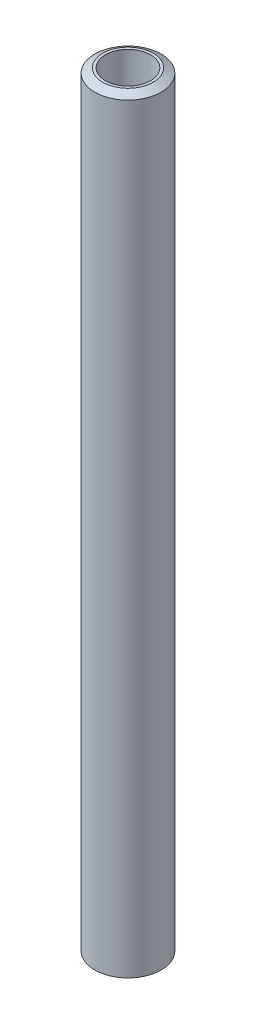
from build123d import *

# Parameters (mm, degrees)
SKICA1_R                 = 12.5
P_IDAT_VYSUNUT_M1_DEPTH  = 290
SKICA2_R                 = 8.5
ODEBRAT_VYSUNUT_M1_DEPTH = 291.538293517
ZKOSEN_1_SIZE            = 3
ZKOSEN_1_SIZE2           = 1.75
ZKOSEN_2_SIZE            = 1.75
ZKOSEN_2_SIZE2           = 3


with BuildPart() as part:
    # Skica1 → P_idat vysunut_m1 (new body)
    with BuildSketch(Plane(origin=(0, 0, 0), x_dir=(1, 0, 0), z_dir=(0, 1, 0))):
        with Locations(Location((0, 0, 0), (0, 0, 270))):
            Circle(SKICA1_R)
    extrude(amount=P_IDAT_VYSUNUT_M1_DEPTH)

    # Skica2 → Odebrat vysunut_m1 (cut, through all)
    with BuildSketch(Plane(origin=(0, 290, 0), x_dir=(1, 0, 0), z_dir=(0, 1, 0))):
        with Locations(Location((0, 0, 0), (0, 0, 270))):
            Circle(SKICA2_R)
    extrude(amount=-ODEBRAT_VYSUNUT_M1_DEPTH, mode=Mode.SUBTRACT)

    # Zkosen_1
    zkosen_1_edges = [part.edges().sort_by_distance(p)[0] for p in [
        (0, 0, -12.5),
    ]]
    zkosen_1_side = [part.faces().sort_by_distance(p)[0] for p in [
        (0, 0, -12.146446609),
    ]]
    chamfer(zkosen_1_edges, length=ZKOSEN_1_SIZE, length2=ZKOSEN_1_SIZE2, reference=zkosen_1_side[0])

    # Zkosen_2
    zkosen_2_edges = [part.edges().sort_by_distance(p)[0] for p in [
        (0, 290, -12.5),
    ]]
    zkosen_2_side = [part.faces().sort_by_distance(p)[0] for p in [
        (0, 145.875, -12.5),
    ]]
    chamfer(zkosen_2_edges, length=ZKOSEN_2_SIZE, length2=ZKOSEN_2_SIZE2, reference=zkosen_2_side[0])


solid = part.part
